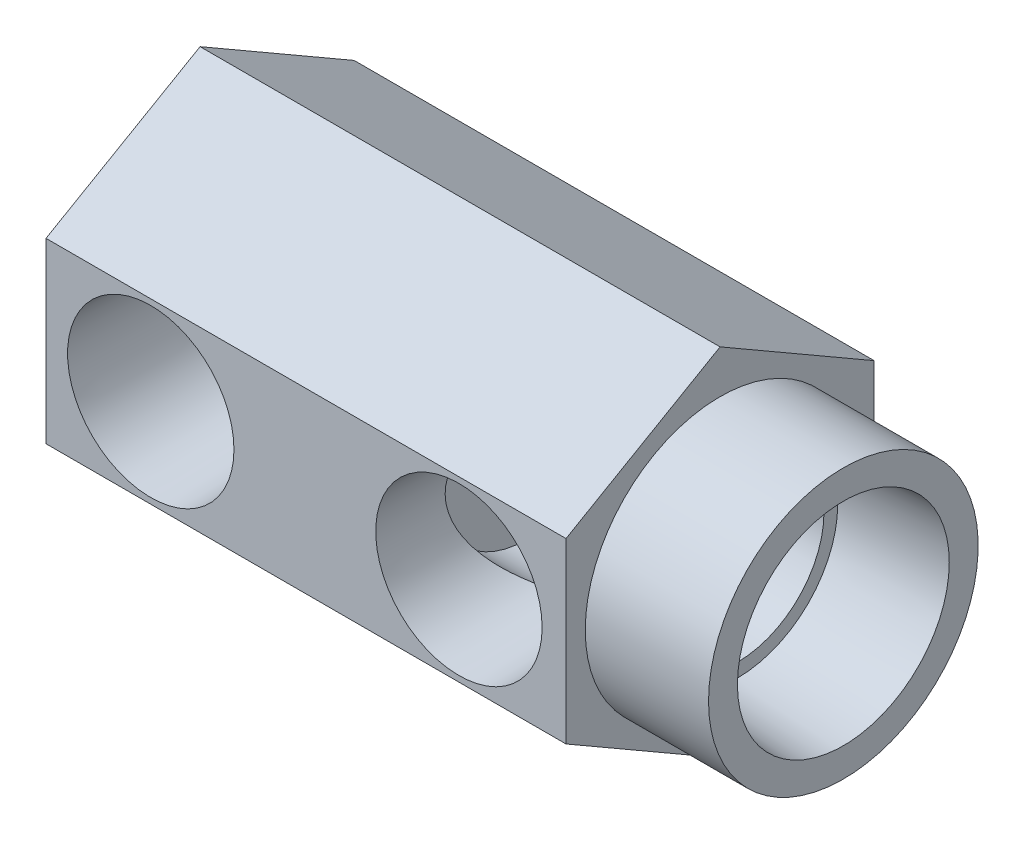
ISO-10303-21;
HEADER;
FILE_DESCRIPTION(('STEP AP214'),'2;1');
FILE_NAME('part.step','',(''),(''),'','','');
FILE_SCHEMA(('AUTOMOTIVE_DESIGN { 1 0 10303 214 1 1 1 1 }'));
ENDSEC;
DATA;
#1=APPLICATION_CONTEXT('core data for automotive mechanical design processes');
#2=APPLICATION_PROTOCOL_DEFINITION('international standard','automotive_design',2000,#1);
#3=PRODUCT_CONTEXT('',#1,'mechanical');
#4=PRODUCT('Part','Part','',(#3));
#5=PRODUCT_RELATED_PRODUCT_CATEGORY('part','',(#4));
#6=PRODUCT_DEFINITION_FORMATION('','',#4);
#7=PRODUCT_DEFINITION_CONTEXT('part definition',#1,'design');
#8=PRODUCT_DEFINITION('design','',#6,#7);
#9=PRODUCT_DEFINITION_SHAPE('','',#8);
#10=(LENGTH_UNIT() NAMED_UNIT(*) SI_UNIT(.MILLI.,.METRE.));
#11=(NAMED_UNIT(*) PLANE_ANGLE_UNIT() SI_UNIT($,.RADIAN.));
#12=(NAMED_UNIT(*) SI_UNIT($,.STERADIAN.) SOLID_ANGLE_UNIT());
#13=UNCERTAINTY_MEASURE_WITH_UNIT(LENGTH_MEASURE(1.E-05),#10,'distance_accuracy_value','');
#14=(GEOMETRIC_REPRESENTATION_CONTEXT(3) GLOBAL_UNCERTAINTY_ASSIGNED_CONTEXT((#13)) GLOBAL_UNIT_ASSIGNED_CONTEXT((#10,
#11,#12)) REPRESENTATION_CONTEXT('',''));
#15=CARTESIAN_POINT('',(0.,0.,0.));
#16=DIRECTION('',(0.,0.,1.));
#17=DIRECTION('',(1.,0.,0.));
#18=AXIS2_PLACEMENT_3D('',#15,#16,#17);
#19=CARTESIAN_POINT('',(53.0225,0.,0.));
#20=DIRECTION('',(-1.,0.,0.));
#21=DIRECTION('',(0.,0.,1.));
#22=AXIS2_PLACEMENT_3D('',#19,#20,#21);
#23=PLANE('',#22);
#24=CARTESIAN_POINT('',(53.0225,0.,0.));
#25=DIRECTION('',(-1.,0.,0.));
#26=DIRECTION('',(0.,0.,1.));
#27=AXIS2_PLACEMENT_3D('',#24,#25,#26);
#28=CIRCLE('',#27,11.1125);
#29=CARTESIAN_POINT('',(53.0225,0.,11.1125));
#30=VERTEX_POINT('',#29);
#31=EDGE_CURVE('E137',#30,#30,#28,.T.);
#32=ORIENTED_EDGE('',*,*,#31,.F.);
#33=EDGE_LOOP('',(#32));
#34=FACE_BOUND('',#33,.T.);
#35=CARTESIAN_POINT('',(53.0225,0.,0.));
#36=DIRECTION('',(-1.,0.,0.));
#37=DIRECTION('',(0.,0.,1.));
#38=AXIS2_PLACEMENT_3D('',#35,#36,#37);
#39=CIRCLE('',#38,8.73125);
#40=CARTESIAN_POINT('',(53.0225,0.,8.73125));
#41=VERTEX_POINT('',#40);
#42=EDGE_CURVE('E161',#41,#41,#39,.T.);
#43=ORIENTED_EDGE('',*,*,#42,.T.);
#44=EDGE_LOOP('',(#43));
#45=FACE_BOUND('',#44,.T.);
#46=ADVANCED_FACE('F35',(#34,#45),#23,.F.);
#47=CARTESIAN_POINT('',(42.8625,-7.33234841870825,-12.7));
#48=DIRECTION('',(0.,0.,1.));
#49=DIRECTION('',(0.,-1.,0.));
#50=AXIS2_PLACEMENT_3D('',#47,#48,#49);
#51=PLANE('',#50);
#52=CARTESIAN_POINT('',(8.636,0.,-12.7));
#53=DIRECTION('',(0.,0.,-1.));
#54=DIRECTION('',(0.,1.,0.));
#55=AXIS2_PLACEMENT_3D('',#52,#53,#54);
#56=CIRCLE('',#55,6.858);
#57=CARTESIAN_POINT('',(8.636,6.858,-12.7));
#58=VERTEX_POINT('',#57);
#59=EDGE_CURVE('E269',#58,#58,#56,.T.);
#60=ORIENTED_EDGE('',*,*,#59,.F.);
#61=EDGE_LOOP('',(#60));
#62=FACE_BOUND('',#61,.T.);
#63=DIRECTION('',(0.,1.,0.));
#64=VECTOR('',#63,1.);
#65=CARTESIAN_POINT('',(0.,-7.33234841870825,-12.7));
#66=LINE('',#65,#64);
#67=CARTESIAN_POINT('',(0.,-7.33234841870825,-12.7));
#68=VERTEX_POINT('',#67);
#69=CARTESIAN_POINT('',(0.,7.33234841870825,-12.7));
#70=VERTEX_POINT('',#69);
#71=EDGE_CURVE('E133',#68,#70,#66,.T.);
#72=ORIENTED_EDGE('',*,*,#71,.T.);
#73=DIRECTION('',(-1.,0.,0.));
#74=VECTOR('',#73,1.);
#75=CARTESIAN_POINT('',(42.8625,7.33234841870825,-12.7));
#76=LINE('',#75,#74);
#77=CARTESIAN_POINT('',(42.8625,7.33234841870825,-12.7));
#78=VERTEX_POINT('',#77);
#79=EDGE_CURVE('E152',#78,#70,#76,.T.);
#80=ORIENTED_EDGE('',*,*,#79,.F.);
#81=DIRECTION('',(0.,1.,0.));
#82=VECTOR('',#81,1.);
#83=CARTESIAN_POINT('',(42.8625,-7.33234841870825,-12.7));
#84=LINE('',#83,#82);
#85=CARTESIAN_POINT('',(42.8625,-7.33234841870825,-12.7));
#86=VERTEX_POINT('',#85);
#87=EDGE_CURVE('E145',#86,#78,#84,.T.);
#88=ORIENTED_EDGE('',*,*,#87,.F.);
#89=DIRECTION('',(-1.,0.,0.));
#90=VECTOR('',#89,1.);
#91=CARTESIAN_POINT('',(42.8625,-7.33234841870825,-12.7));
#92=LINE('',#91,#90);
#93=EDGE_CURVE('E129',#86,#68,#92,.T.);
#94=ORIENTED_EDGE('',*,*,#93,.T.);
#95=EDGE_LOOP('',(#72,#80,#88,#94));
#96=FACE_BOUND('',#95,.T.);
#97=ADVANCED_FACE('F37',(#62,#96),#51,.F.);
#98=CARTESIAN_POINT('',(42.8625,7.33234841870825,-12.7));
#99=DIRECTION('',(0.,-0.866025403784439,0.5));
#100=DIRECTION('',(0.,-0.5,-0.866025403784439));
#101=AXIS2_PLACEMENT_3D('',#98,#99,#100);
#102=PLANE('',#101);
#103=DIRECTION('',(0.,0.5,0.866025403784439));
#104=VECTOR('',#103,1.);
#105=CARTESIAN_POINT('',(0.,7.33234841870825,-12.7));
#106=LINE('',#105,#104);
#107=CARTESIAN_POINT('',(0.,14.6646968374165,0.));
#108=VERTEX_POINT('',#107);
#109=EDGE_CURVE('E136',#70,#108,#106,.T.);
#110=ORIENTED_EDGE('',*,*,#109,.T.);
#111=DIRECTION('',(-1.,0.,0.));
#112=VECTOR('',#111,1.);
#113=CARTESIAN_POINT('',(42.8625,14.6646968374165,0.));
#114=LINE('',#113,#112);
#115=CARTESIAN_POINT('',(42.8625,14.6646968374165,0.));
#116=VERTEX_POINT('',#115);
#117=EDGE_CURVE('E149',#116,#108,#114,.T.);
#118=ORIENTED_EDGE('',*,*,#117,.F.);
#119=DIRECTION('',(0.,0.5,0.866025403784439));
#120=VECTOR('',#119,1.);
#121=CARTESIAN_POINT('',(42.8625,7.33234841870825,-12.7));
#122=LINE('',#121,#120);
#123=EDGE_CURVE('E96',#78,#116,#122,.T.);
#124=ORIENTED_EDGE('',*,*,#123,.F.);
#125=ORIENTED_EDGE('',*,*,#79,.T.);
#126=EDGE_LOOP('',(#110,#118,#124,#125));
#127=FACE_BOUND('',#126,.T.);
#128=ADVANCED_FACE('F197',(#127),#102,.F.);
#129=CARTESIAN_POINT('',(42.8625,14.6646968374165,0.));
#130=DIRECTION('',(0.,-0.866025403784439,-0.5));
#131=DIRECTION('',(0.,0.5,-0.866025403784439));
#132=AXIS2_PLACEMENT_3D('',#129,#130,#131);
#133=PLANE('',#132);
#134=DIRECTION('',(0.,-0.5,0.866025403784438));
#135=VECTOR('',#134,1.);
#136=CARTESIAN_POINT('',(0.,14.6646968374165,0.));
#137=LINE('',#136,#135);
#138=CARTESIAN_POINT('',(0.,7.33234841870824,12.7));
#139=VERTEX_POINT('',#138);
#140=EDGE_CURVE('E139',#108,#139,#137,.T.);
#141=ORIENTED_EDGE('',*,*,#140,.T.);
#142=DIRECTION('',(-1.,0.,0.));
#143=VECTOR('',#142,1.);
#144=CARTESIAN_POINT('',(42.8625,7.33234841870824,12.7));
#145=LINE('',#144,#143);
#146=CARTESIAN_POINT('',(42.8625,7.33234841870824,12.7));
#147=VERTEX_POINT('',#146);
#148=EDGE_CURVE('E124',#147,#139,#145,.T.);
#149=ORIENTED_EDGE('',*,*,#148,.F.);
#150=DIRECTION('',(0.,-0.5,0.866025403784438));
#151=VECTOR('',#150,1.);
#152=CARTESIAN_POINT('',(42.8625,14.6646968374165,0.));
#153=LINE('',#152,#151);
#154=EDGE_CURVE('E112',#116,#147,#153,.T.);
#155=ORIENTED_EDGE('',*,*,#154,.F.);
#156=ORIENTED_EDGE('',*,*,#117,.T.);
#157=EDGE_LOOP('',(#141,#149,#155,#156));
#158=FACE_BOUND('',#157,.T.);
#159=ADVANCED_FACE('F222',(#158),#133,.F.);
#160=CARTESIAN_POINT('',(42.8625,7.33234841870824,12.7));
#161=DIRECTION('',(0.,0.,-1.));
#162=DIRECTION('',(-1.,0.,0.));
#163=AXIS2_PLACEMENT_3D('',#160,#161,#162);
#164=PLANE('',#163);
#165=CARTESIAN_POINT('',(8.636,0.,12.7));
#166=DIRECTION('',(0.,0.,1.));
#167=DIRECTION('',(1.,0.,0.));
#168=AXIS2_PLACEMENT_3D('',#165,#166,#167);
#169=CIRCLE('',#168,6.858);
#170=CARTESIAN_POINT('',(15.494,0.,12.7));
#171=VERTEX_POINT('',#170);
#172=EDGE_CURVE('E260',#171,#171,#169,.T.);
#173=ORIENTED_EDGE('',*,*,#172,.F.);
#174=EDGE_LOOP('',(#173));
#175=FACE_BOUND('',#174,.T.);
#176=CARTESIAN_POINT('',(34.036,0.,12.7));
#177=DIRECTION('',(0.,0.,1.));
#178=DIRECTION('',(1.,0.,0.));
#179=AXIS2_PLACEMENT_3D('',#176,#177,#178);
#180=CIRCLE('',#179,6.858);
#181=CARTESIAN_POINT('',(40.894,0.,12.7));
#182=VERTEX_POINT('',#181);
#183=EDGE_CURVE('E162',#182,#182,#180,.T.);
#184=ORIENTED_EDGE('',*,*,#183,.F.);
#185=EDGE_LOOP('',(#184));
#186=FACE_BOUND('',#185,.T.);
#187=DIRECTION('',(0.,-1.,0.));
#188=VECTOR('',#187,1.);
#189=CARTESIAN_POINT('',(0.,7.33234841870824,12.7));
#190=LINE('',#189,#188);
#191=CARTESIAN_POINT('',(0.,-7.33234841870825,12.7));
#192=VERTEX_POINT('',#191);
#193=EDGE_CURVE('E121',#139,#192,#190,.T.);
#194=ORIENTED_EDGE('',*,*,#193,.T.);
#195=DIRECTION('',(-1.,0.,0.));
#196=VECTOR('',#195,1.);
#197=CARTESIAN_POINT('',(42.8625,-7.33234841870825,12.7));
#198=LINE('',#197,#196);
#199=CARTESIAN_POINT('',(42.8625,-7.33234841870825,12.7));
#200=VERTEX_POINT('',#199);
#201=EDGE_CURVE('E118',#200,#192,#198,.T.);
#202=ORIENTED_EDGE('',*,*,#201,.F.);
#203=DIRECTION('',(0.,-1.,0.));
#204=VECTOR('',#203,1.);
#205=CARTESIAN_POINT('',(42.8625,7.33234841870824,12.7));
#206=LINE('',#205,#204);
#207=EDGE_CURVE('E105',#147,#200,#206,.T.);
#208=ORIENTED_EDGE('',*,*,#207,.F.);
#209=ORIENTED_EDGE('',*,*,#148,.T.);
#210=EDGE_LOOP('',(#194,#202,#208,#209));
#211=FACE_BOUND('',#210,.T.);
#212=ADVANCED_FACE('F119',(#175,#186,#211),#164,.F.);
#213=CARTESIAN_POINT('',(42.8625,-7.33234841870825,12.7));
#214=DIRECTION('',(0.,0.866025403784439,-0.5));
#215=DIRECTION('',(0.,0.5,0.866025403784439));
#216=AXIS2_PLACEMENT_3D('',#213,#214,#215);
#217=PLANE('',#216);
#218=DIRECTION('',(0.,-0.5,-0.866025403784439));
#219=VECTOR('',#218,1.);
#220=CARTESIAN_POINT('',(0.,-7.33234841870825,12.7));
#221=LINE('',#220,#219);
#222=CARTESIAN_POINT('',(0.,-14.6646968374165,0.));
#223=VERTEX_POINT('',#222);
#224=EDGE_CURVE('E142',#192,#223,#221,.T.);
#225=ORIENTED_EDGE('',*,*,#224,.T.);
#226=DIRECTION('',(-1.,0.,0.));
#227=VECTOR('',#226,1.);
#228=CARTESIAN_POINT('',(42.8625,-14.6646968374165,0.));
#229=LINE('',#228,#227);
#230=CARTESIAN_POINT('',(42.8625,-14.6646968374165,0.));
#231=VERTEX_POINT('',#230);
#232=EDGE_CURVE('E125',#231,#223,#229,.T.);
#233=ORIENTED_EDGE('',*,*,#232,.F.);
#234=DIRECTION('',(0.,-0.5,-0.866025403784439));
#235=VECTOR('',#234,1.);
#236=CARTESIAN_POINT('',(42.8625,-7.33234841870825,12.7));
#237=LINE('',#236,#235);
#238=EDGE_CURVE('E109',#200,#231,#237,.T.);
#239=ORIENTED_EDGE('',*,*,#238,.F.);
#240=ORIENTED_EDGE('',*,*,#201,.T.);
#241=EDGE_LOOP('',(#225,#233,#239,#240));
#242=FACE_BOUND('',#241,.T.);
#243=ADVANCED_FACE('F127',(#242),#217,.F.);
#244=CARTESIAN_POINT('',(42.8625,-14.6646968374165,0.));
#245=DIRECTION('',(0.,0.866025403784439,0.5));
#246=DIRECTION('',(0.,-0.5,0.866025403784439));
#247=AXIS2_PLACEMENT_3D('',#244,#245,#246);
#248=PLANE('',#247);
#249=DIRECTION('',(0.,0.5,-0.866025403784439));
#250=VECTOR('',#249,1.);
#251=CARTESIAN_POINT('',(0.,-14.6646968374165,0.));
#252=LINE('',#251,#250);
#253=EDGE_CURVE('E87',#223,#68,#252,.T.);
#254=ORIENTED_EDGE('',*,*,#253,.T.);
#255=ORIENTED_EDGE('',*,*,#93,.F.);
#256=DIRECTION('',(0.,0.5,-0.866025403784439));
#257=VECTOR('',#256,1.);
#258=CARTESIAN_POINT('',(42.8625,-14.6646968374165,0.));
#259=LINE('',#258,#257);
#260=EDGE_CURVE('E60',#231,#86,#259,.T.);
#261=ORIENTED_EDGE('',*,*,#260,.F.);
#262=ORIENTED_EDGE('',*,*,#232,.T.);
#263=EDGE_LOOP('',(#254,#255,#261,#262));
#264=FACE_BOUND('',#263,.T.);
#265=ADVANCED_FACE('F211',(#264),#248,.F.);
#266=CARTESIAN_POINT('',(42.8625,7.33234841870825,-12.7));
#267=DIRECTION('',(1.,0.,0.));
#268=DIRECTION('',(0.,0.,-1.));
#269=AXIS2_PLACEMENT_3D('',#266,#267,#268);
#270=PLANE('',#269);
#271=CARTESIAN_POINT('',(42.8625,0.,0.));
#272=DIRECTION('',(1.,0.,0.));
#273=DIRECTION('',(0.,0.,-1.));
#274=AXIS2_PLACEMENT_3D('',#271,#272,#273);
#275=CIRCLE('',#274,11.1125);
#276=CARTESIAN_POINT('',(42.8625,0.,11.1125));
#277=VERTEX_POINT('',#276);
#278=EDGE_CURVE('E44',#277,#277,#275,.T.);
#279=ORIENTED_EDGE('',*,*,#278,.F.);
#280=EDGE_LOOP('',(#279));
#281=FACE_BOUND('',#280,.T.);
#282=ORIENTED_EDGE('',*,*,#87,.T.);
#283=ORIENTED_EDGE('',*,*,#123,.T.);
#284=ORIENTED_EDGE('',*,*,#154,.T.);
#285=ORIENTED_EDGE('',*,*,#207,.T.);
#286=ORIENTED_EDGE('',*,*,#238,.T.);
#287=ORIENTED_EDGE('',*,*,#260,.T.);
#288=EDGE_LOOP('',(#282,#283,#284,#285,#286,#287));
#289=FACE_BOUND('',#288,.T.);
#290=ADVANCED_FACE('F107',(#281,#289),#270,.T.);
#291=CARTESIAN_POINT('',(0.,7.33234841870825,-12.7));
#292=DIRECTION('',(1.,0.,0.));
#293=DIRECTION('',(0.,0.,-1.));
#294=AXIS2_PLACEMENT_3D('',#291,#292,#293);
#295=PLANE('',#294);
#296=ORIENTED_EDGE('',*,*,#71,.F.);
#297=ORIENTED_EDGE('',*,*,#253,.F.);
#298=ORIENTED_EDGE('',*,*,#224,.F.);
#299=ORIENTED_EDGE('',*,*,#193,.F.);
#300=ORIENTED_EDGE('',*,*,#140,.F.);
#301=ORIENTED_EDGE('',*,*,#109,.F.);
#302=EDGE_LOOP('',(#296,#297,#298,#299,#300,#301));
#303=FACE_BOUND('',#302,.T.);
#304=ADVANCED_FACE('F207',(#303),#295,.F.);
#305=CARTESIAN_POINT('',(53.0225,0.,0.));
#306=DIRECTION('',(-1.,0.,0.));
#307=DIRECTION('',(0.,0.,1.));
#308=AXIS2_PLACEMENT_3D('',#305,#306,#307);
#309=CYLINDRICAL_SURFACE('',#308,11.1125);
#310=CARTESIAN_POINT('',(42.8625,0.,11.1125));
#311=CARTESIAN_POINT('',(42.9683333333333,0.,11.1125));
#312=CARTESIAN_POINT('',(43.0741666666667,0.,11.1125));
#313=CARTESIAN_POINT('',(43.2858333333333,0.,11.1125));
#314=CARTESIAN_POINT('',(43.3916666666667,0.,11.1125));
#315=CARTESIAN_POINT('',(43.6033333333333,0.,11.1125));
#316=CARTESIAN_POINT('',(43.7091666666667,0.,11.1125));
#317=CARTESIAN_POINT('',(43.9208333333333,0.,11.1125));
#318=CARTESIAN_POINT('',(44.0266666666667,0.,11.1125));
#319=CARTESIAN_POINT('',(44.2383333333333,0.,11.1125));
#320=CARTESIAN_POINT('',(44.3441666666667,0.,11.1125));
#321=CARTESIAN_POINT('',(44.5558333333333,0.,11.1125));
#322=CARTESIAN_POINT('',(44.6616666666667,0.,11.1125));
#323=CARTESIAN_POINT('',(44.8733333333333,0.,11.1125));
#324=CARTESIAN_POINT('',(44.9791666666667,0.,11.1125));
#325=CARTESIAN_POINT('',(45.1908333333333,0.,11.1125));
#326=CARTESIAN_POINT('',(45.2966666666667,0.,11.1125));
#327=CARTESIAN_POINT('',(45.5083333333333,0.,11.1125));
#328=CARTESIAN_POINT('',(45.6141666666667,0.,11.1125));
#329=CARTESIAN_POINT('',(45.8258333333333,0.,11.1125));
#330=CARTESIAN_POINT('',(45.9316666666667,0.,11.1125));
#331=CARTESIAN_POINT('',(46.1433333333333,0.,11.1125));
#332=CARTESIAN_POINT('',(46.2491666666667,0.,11.1125));
#333=CARTESIAN_POINT('',(46.4608333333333,0.,11.1125));
#334=CARTESIAN_POINT('',(46.5666666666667,0.,11.1125));
#335=CARTESIAN_POINT('',(46.7783333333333,0.,11.1125));
#336=CARTESIAN_POINT('',(46.8841666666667,0.,11.1125));
#337=CARTESIAN_POINT('',(47.0958333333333,0.,11.1125));
#338=CARTESIAN_POINT('',(47.2016666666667,0.,11.1125));
#339=CARTESIAN_POINT('',(47.4133333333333,0.,11.1125));
#340=CARTESIAN_POINT('',(47.5191666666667,0.,11.1125));
#341=CARTESIAN_POINT('',(47.7308333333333,0.,11.1125));
#342=CARTESIAN_POINT('',(47.8366666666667,0.,11.1125));
#343=CARTESIAN_POINT('',(48.0483333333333,0.,11.1125));
#344=CARTESIAN_POINT('',(48.1541666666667,0.,11.1125));
#345=CARTESIAN_POINT('',(48.3658333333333,0.,11.1125));
#346=CARTESIAN_POINT('',(48.4716666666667,0.,11.1125));
#347=CARTESIAN_POINT('',(48.6833333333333,0.,11.1125));
#348=CARTESIAN_POINT('',(48.7891666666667,0.,11.1125));
#349=CARTESIAN_POINT('',(49.0008333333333,0.,11.1125));
#350=CARTESIAN_POINT('',(49.1066666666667,0.,11.1125));
#351=CARTESIAN_POINT('',(49.3183333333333,0.,11.1125));
#352=CARTESIAN_POINT('',(49.4241666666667,0.,11.1125));
#353=CARTESIAN_POINT('',(49.6358333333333,0.,11.1125));
#354=CARTESIAN_POINT('',(49.7416666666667,0.,11.1125));
#355=CARTESIAN_POINT('',(49.9533333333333,0.,11.1125));
#356=CARTESIAN_POINT('',(50.0591666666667,0.,11.1125));
#357=CARTESIAN_POINT('',(50.2708333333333,0.,11.1125));
#358=CARTESIAN_POINT('',(50.3766666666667,0.,11.1125));
#359=CARTESIAN_POINT('',(50.5883333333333,0.,11.1125));
#360=CARTESIAN_POINT('',(50.6941666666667,0.,11.1125));
#361=CARTESIAN_POINT('',(50.9058333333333,0.,11.1125));
#362=CARTESIAN_POINT('',(51.0116666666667,0.,11.1125));
#363=CARTESIAN_POINT('',(51.2233333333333,0.,11.1125));
#364=CARTESIAN_POINT('',(51.3291666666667,0.,11.1125));
#365=CARTESIAN_POINT('',(51.5408333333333,0.,11.1125));
#366=CARTESIAN_POINT('',(51.6466666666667,0.,11.1125));
#367=CARTESIAN_POINT('',(51.8583333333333,0.,11.1125));
#368=CARTESIAN_POINT('',(51.9641666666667,0.,11.1125));
#369=CARTESIAN_POINT('',(52.1758333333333,0.,11.1125));
#370=CARTESIAN_POINT('',(52.2816666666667,0.,11.1125));
#371=CARTESIAN_POINT('',(52.4933333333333,0.,11.1125));
#372=CARTESIAN_POINT('',(52.5991666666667,0.,11.1125));
#373=CARTESIAN_POINT('',(52.8108333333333,0.,11.1125));
#374=CARTESIAN_POINT('',(52.9166666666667,0.,11.1125));
#375=CARTESIAN_POINT('',(53.0225,0.,11.1125));
#376=B_SPLINE_CURVE_WITH_KNOTS('',3,(#310,#311,#312,#313,#314,#315,#316,#317,#318,#319,#320,
#321,#322,#323,#324,#325,#326,#327,#328,#329,#330,#331,#332,#333,#334,#335,#336,#337,#338,#339,
#340,#341,#342,#343,#344,#345,#346,#347,#348,#349,#350,#351,#352,#353,#354,#355,#356,#357,#358,
#359,#360,#361,#362,#363,#364,#365,#366,#367,#368,#369,#370,#371,#372,#373,#374,#375),
.UNSPECIFIED.,.F.,.F.,(4,2,2,2,2,2,2,2,2,2,2,2,2,2,2,2,2,2,2,2,2,2,2,2,2,2,2,2,2,2,2,2,4),(0.,
0.317500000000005,0.635000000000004,0.952500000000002,1.27,1.5875,1.905,2.2225,2.54,
2.85750000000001,3.175,3.4925,3.81,4.12750000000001,4.445,4.7625,5.08,5.39750000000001,
5.71500000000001,6.0325,6.35,6.66750000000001,6.985,7.3025,7.62,7.93750000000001,
8.25500000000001,8.5725,8.89000000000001,9.20750000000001,9.52500000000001,9.8425,10.16),.UNSPECIFIED.);
#377=EDGE_CURVE('BSEAM204',#277,#30,#376,.T.);
#378=ORIENTED_EDGE('',*,*,#278,.T.);
#379=ORIENTED_EDGE('',*,*,#31,.T.);
#380=ORIENTED_EDGE('',*,*,#377,.T.);
#381=ORIENTED_EDGE('',*,*,#377,.F.);
#382=EDGE_LOOP('',(#378,#380,#379,#381));
#383=FACE_BOUND('',#382,.T.);
#384=ADVANCED_FACE('F204',(#383),#309,.T.);
#385=CARTESIAN_POINT('',(53.0225,0.,0.));
#386=DIRECTION('',(1.,0.,0.));
#387=DIRECTION('',(0.,0.,-1.));
#388=AXIS2_PLACEMENT_3D('',#385,#386,#387);
#389=CONICAL_SURFACE('',#388,8.73125,0.0523598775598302);
#390=CARTESIAN_POINT('',(44.2849,0.,0.));
#391=DIRECTION('',(-1.,0.,0.));
#392=DIRECTION('',(0.,0.,1.));
#393=AXIS2_PLACEMENT_3D('',#390,#391,#392);
#394=CIRCLE('',#393,8.2733317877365);
#395=CARTESIAN_POINT('',(44.2849,0.,8.2733317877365));
#396=VERTEX_POINT('',#395);
#397=EDGE_CURVE('E241',#396,#396,#394,.T.);
#398=ORIENTED_EDGE('',*,*,#397,.T.);
#399=EDGE_LOOP('',(#398));
#400=FACE_BOUND('',#399,.T.);
#401=ORIENTED_EDGE('',*,*,#42,.F.);
#402=EDGE_LOOP('',(#401));
#403=FACE_BOUND('',#402,.T.);
#404=ADVANCED_FACE('F203',(#400,#403),#389,.F.);
#405=CARTESIAN_POINT('',(44.2849,0.,-7.14375));
#406=DIRECTION('',(1.,0.,0.));
#407=DIRECTION('',(0.,0.,-1.));
#408=AXIS2_PLACEMENT_3D('',#405,#406,#407);
#409=PLANE('',#408);
#410=CARTESIAN_POINT('',(44.2849,0.,0.));
#411=DIRECTION('',(-1.,0.,0.));
#412=DIRECTION('',(0.,0.,1.));
#413=AXIS2_PLACEMENT_3D('',#410,#411,#412);
#414=CIRCLE('',#413,7.14375);
#415=CARTESIAN_POINT('',(44.2849,0.,7.14375));
#416=VERTEX_POINT('',#415);
#417=EDGE_CURVE('E244',#416,#416,#414,.T.);
#418=ORIENTED_EDGE('',*,*,#417,.T.);
#419=EDGE_LOOP('',(#418));
#420=FACE_BOUND('',#419,.T.);
#421=ORIENTED_EDGE('',*,*,#397,.F.);
#422=EDGE_LOOP('',(#421));
#423=FACE_BOUND('',#422,.T.);
#424=ADVANCED_FACE('F187',(#420,#423),#409,.T.);
#425=CARTESIAN_POINT('',(0.,0.,0.));
#426=DIRECTION('',(-1.,0.,0.));
#427=DIRECTION('',(0.,0.,1.));
#428=AXIS2_PLACEMENT_3D('',#425,#426,#427);
#429=CYLINDRICAL_SURFACE('',#428,7.14375);
#430=CARTESIAN_POINT('',(29.5083238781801,-4.84980912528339,5.24523766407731));
#431=CARTESIAN_POINT('',(29.3823544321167,-4.73649479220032,5.35000911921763));
#432=CARTESIAN_POINT('',(29.2599964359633,-4.61761883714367,5.45310749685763));
#433=CARTESIAN_POINT('',(29.0231642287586,-4.36856062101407,5.65460311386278));
#434=CARTESIAN_POINT('',(28.9086917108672,-4.2383759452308,5.75299934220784));
#435=CARTESIAN_POINT('',(28.5788727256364,-3.83115643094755,6.03862646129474));
#436=CARTESIAN_POINT('',(28.3763742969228,-3.5367918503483,6.21692838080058));
#437=CARTESIAN_POINT('',(28.0538983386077,-2.96968952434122,6.50328768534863));
#438=CARTESIAN_POINT('',(27.9255188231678,-2.70526788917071,6.61823869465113));
#439=CARTESIAN_POINT('',(27.7586939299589,-2.29028648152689,6.76826870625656));
#440=CARTESIAN_POINT('',(27.7073630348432,-2.14884896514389,6.8145581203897));
#441=CARTESIAN_POINT('',(27.6140676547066,-1.86054994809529,6.89884323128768));
#442=CARTESIAN_POINT('',(27.5720989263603,-1.71369093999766,6.93684268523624));
#443=CARTESIAN_POINT('',(27.4979485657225,-1.414195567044,7.00406775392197));
#444=CARTESIAN_POINT('',(27.4658506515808,-1.26152149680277,7.03321829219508));
#445=CARTESIAN_POINT('',(27.4125567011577,-0.952726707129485,7.08165900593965));
#446=CARTESIAN_POINT('',(27.3913607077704,-0.796605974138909,7.10094914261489));
#447=CARTESIAN_POINT('',(27.3603434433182,-0.482397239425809,7.12918813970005));
#448=CARTESIAN_POINT('',(27.3505155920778,-0.324310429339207,7.13814298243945));
#449=CARTESIAN_POINT('',(27.3424395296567,-0.00760472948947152,7.14550111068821));
#450=CARTESIAN_POINT('',(27.3441899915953,0.151014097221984,7.14390560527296));
#451=CARTESIAN_POINT('',(27.3582642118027,0.447084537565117,7.13108429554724));
#452=CARTESIAN_POINT('',(27.3692131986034,0.584659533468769,7.12111067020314));
#453=CARTESIAN_POINT('',(27.3997039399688,0.858102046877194,7.09335714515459));
#454=CARTESIAN_POINT('',(27.4192484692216,0.993968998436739,7.07557472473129));
#455=CARTESIAN_POINT('',(27.466605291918,1.26299966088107,7.03253460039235));
#456=CARTESIAN_POINT('',(27.4944148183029,1.39616426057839,7.00727939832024));
#457=CARTESIAN_POINT('',(27.5578761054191,1.65907882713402,6.94973123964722));
#458=CARTESIAN_POINT('',(27.5935308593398,1.78882746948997,6.91743559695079));
#459=CARTESIAN_POINT('',(27.7129858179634,2.17658998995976,6.80942962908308));
#460=CARTESIAN_POINT('',(27.8084072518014,2.42828613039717,6.72339475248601));
#461=CARTESIAN_POINT('',(28.0252282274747,2.91081077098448,6.52902769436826));
#462=CARTESIAN_POINT('',(28.1466402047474,3.14162920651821,6.4206848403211));
#463=CARTESIAN_POINT('',(28.3782585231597,3.52618432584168,6.21564053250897));
#464=CARTESIAN_POINT('',(28.4837716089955,3.68483726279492,6.12271976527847));
#465=CARTESIAN_POINT('',(28.7055260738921,3.98924030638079,5.92888551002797));
#466=CARTESIAN_POINT('',(28.8217685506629,4.13498908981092,5.82797120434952));
#467=CARTESIAN_POINT('',(29.0639877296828,4.4139197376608,5.61968420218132));
#468=CARTESIAN_POINT('',(29.1899871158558,4.54707061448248,5.51229659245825));
#469=CARTESIAN_POINT('',(29.4505015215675,4.80059283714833,5.29297268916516));
#470=CARTESIAN_POINT('',(29.5850153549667,4.92096595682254,5.18103702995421));
#471=CARTESIAN_POINT('',(29.8652504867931,5.15193999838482,4.95154587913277));
#472=CARTESIAN_POINT('',(30.0111628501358,5.26223846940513,4.83392000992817));
#473=CARTESIAN_POINT('',(30.3109913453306,5.47001778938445,4.5974813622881));
#474=CARTESIAN_POINT('',(30.4649093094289,5.56749568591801,4.47866831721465));
#475=CARTESIAN_POINT('',(30.7805694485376,5.74962950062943,4.24230260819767));
#476=CARTESIAN_POINT('',(30.9422973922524,5.83430765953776,4.12474809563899));
#477=CARTESIAN_POINT('',(31.2743883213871,5.99102033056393,3.8936229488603));
#478=CARTESIAN_POINT('',(31.4447466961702,6.06306150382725,3.7800502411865));
#479=CARTESIAN_POINT('',(31.7978500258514,6.19515862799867,3.55947956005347));
#480=CARTESIAN_POINT('',(31.9807328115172,6.25503666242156,3.45259311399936));
#481=CARTESIAN_POINT('',(32.358632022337,6.36064590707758,3.25391190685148));
#482=CARTESIAN_POINT('',(32.5536444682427,6.40638172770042,3.1621122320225));
#483=CARTESIAN_POINT('',(32.9222061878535,6.47520032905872,3.01831607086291));
#484=CARTESIAN_POINT('',(33.0935699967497,6.50084233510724,2.9621704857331));
#485=CARTESIAN_POINT('',(33.3562389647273,6.52980353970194,2.89747888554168));
#486=CARTESIAN_POINT('',(33.4446376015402,6.53787016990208,2.87917840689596));
#487=CARTESIAN_POINT('',(33.6228631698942,6.55066806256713,2.84994222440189));
#488=CARTESIAN_POINT('',(33.7126893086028,6.55540111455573,2.83900256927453));
#489=CARTESIAN_POINT('',(33.8939412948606,6.56142550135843,2.82505214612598));
#490=CARTESIAN_POINT('',(33.9853742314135,6.56268366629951,2.82211779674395));
#491=CARTESIAN_POINT('',(34.1681034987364,6.56162318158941,2.82458265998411));
#492=CARTESIAN_POINT('',(34.2593998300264,6.55930454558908,2.82998184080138));
#493=CARTESIAN_POINT('',(34.4411485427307,6.55115703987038,2.84879031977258));
#494=CARTESIAN_POINT('',(34.5315992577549,6.54532230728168,2.86221299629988));
#495=CARTESIAN_POINT('',(34.7108593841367,6.53030374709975,2.89631629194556));
#496=CARTESIAN_POINT('',(34.7996676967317,6.52111775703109,2.91700159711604));
#497=CARTESIAN_POINT('',(35.1206850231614,6.48175953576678,3.00411504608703));
#498=CARTESIAN_POINT('',(35.3466817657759,6.44203402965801,3.08954587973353));
#499=CARTESIAN_POINT('',(35.6732857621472,6.36852534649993,3.23699418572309));
#500=CARTESIAN_POINT('',(35.7803260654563,6.34162243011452,3.28950733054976));
#501=CARTESIAN_POINT('',(35.9906747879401,6.28341303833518,3.3993741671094));
#502=CARTESIAN_POINT('',(36.0939843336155,6.25210790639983,3.45672637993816));
#503=CARTESIAN_POINT('',(36.3931128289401,6.15375523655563,3.63067422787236));
#504=CARTESIAN_POINT('',(36.5841984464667,6.08086385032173,3.7520873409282));
#505=CARTESIAN_POINT('',(36.9555584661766,5.91986154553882,4.00131490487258));
#506=CARTESIAN_POINT('',(37.1358239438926,5.83173828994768,4.12913448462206));
#507=CARTESIAN_POINT('',(37.4867903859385,5.64023525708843,4.38711347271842));
#508=CARTESIAN_POINT('',(37.6574766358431,5.53683284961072,4.51727609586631));
#509=CARTESIAN_POINT('',(37.9892506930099,5.3147090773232,4.77663018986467));
#510=CARTESIAN_POINT('',(38.1503414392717,5.19599243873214,4.90582194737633));
#511=CARTESIAN_POINT('',(38.4717958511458,4.93546969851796,5.16821607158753));
#512=CARTESIAN_POINT('',(38.6315672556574,4.79271987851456,5.3012118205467));
#513=CARTESIAN_POINT('',(38.9390566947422,4.48916243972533,5.56061661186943));
#514=CARTESIAN_POINT('',(39.0867710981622,4.32834941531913,5.6870236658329));
#515=CARTESIAN_POINT('',(39.3678859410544,3.98902350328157,5.92994514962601));
#516=CARTESIAN_POINT('',(39.5013354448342,3.81057563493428,6.04649318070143));
#517=CARTESIAN_POINT('',(39.752163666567,3.43564684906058,6.26711376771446));
#518=CARTESIAN_POINT('',(39.8695553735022,3.2391807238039,6.37119639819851));
#519=CARTESIAN_POINT('',(40.043053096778,2.90961722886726,6.52581221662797));
#520=CARTESIAN_POINT('',(40.1051179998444,2.78194628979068,6.58131911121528));
#521=CARTESIAN_POINT('',(40.2216078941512,2.52059498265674,6.68577221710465));
#522=CARTESIAN_POINT('',(40.2760352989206,2.3869165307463,6.73472050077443));
#523=CARTESIAN_POINT('',(40.376533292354,2.11406523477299,6.82528758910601));
#524=CARTESIAN_POINT('',(40.4226054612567,1.97489343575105,6.866907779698));
#525=CARTESIAN_POINT('',(40.5056828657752,1.69180247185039,6.94207470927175));
#526=CARTESIAN_POINT('',(40.5426923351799,1.54788555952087,6.97562521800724));
#527=CARTESIAN_POINT('',(40.6072652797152,1.25509157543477,7.03422762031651));
#528=CARTESIAN_POINT('',(40.6347578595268,1.10618597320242,7.0592157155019));
#529=CARTESIAN_POINT('',(40.6793863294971,0.805558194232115,7.09980580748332));
#530=CARTESIAN_POINT('',(40.6965222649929,0.653836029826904,7.11540784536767));
#531=CARTESIAN_POINT('',(40.7200772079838,0.348924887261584,7.13685958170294));
#532=CARTESIAN_POINT('',(40.7264998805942,0.195736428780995,7.14271261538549));
#533=CARTESIAN_POINT('',(40.7284996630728,-0.11076323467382,7.14453469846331));
#534=CARTESIAN_POINT('',(40.7240776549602,-0.264074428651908,7.14050455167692));
#535=CARTESIAN_POINT('',(40.7055001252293,-0.553666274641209,7.12358332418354));
#536=CARTESIAN_POINT('',(40.692395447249,-0.690072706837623,7.11164893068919));
#537=CARTESIAN_POINT('',(40.657762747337,-0.960961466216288,7.08013539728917));
#538=CARTESIAN_POINT('',(40.6362319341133,-1.09544314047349,7.06055372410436));
#539=CARTESIAN_POINT('',(40.5850957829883,-1.36153495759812,7.01410132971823));
#540=CARTESIAN_POINT('',(40.5554928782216,-1.49314595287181,6.98723280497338));
#541=CARTESIAN_POINT('',(40.4886493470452,-1.75282536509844,6.92665689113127));
#542=CARTESIAN_POINT('',(40.4514058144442,-1.88089241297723,6.89294689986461));
#543=CARTESIAN_POINT('',(40.3263826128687,-2.26669765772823,6.77999855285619));
#544=CARTESIAN_POINT('',(40.2269267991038,-2.51776508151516,6.69041804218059));
#545=CARTESIAN_POINT('',(40.0022484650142,-2.99843474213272,6.4892707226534));
#546=CARTESIAN_POINT('',(39.877013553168,-3.22802657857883,6.37769334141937));
#547=CARTESIAN_POINT('',(39.6380534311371,-3.61140511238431,6.16656639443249));
#548=CARTESIAN_POINT('',(39.5288753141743,-3.77009214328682,6.07063896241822));
#549=CARTESIAN_POINT('',(39.2997324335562,-4.07416103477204,5.87089981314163));
#550=CARTESIAN_POINT('',(39.1797664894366,-4.21954143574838,5.76708723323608));
#551=CARTESIAN_POINT('',(38.9300085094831,-4.497397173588,5.55314411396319));
#552=CARTESIAN_POINT('',(38.8001919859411,-4.62983834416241,5.44299800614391));
#553=CARTESIAN_POINT('',(38.5319557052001,-4.88160155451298,5.21838873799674));
#554=CARTESIAN_POINT('',(38.3935372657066,-5.00092559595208,5.10392623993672));
#555=CARTESIAN_POINT('',(38.1051984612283,-5.22949913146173,4.86959276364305));
#556=CARTESIAN_POINT('',(37.9550801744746,-5.33843282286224,4.74965795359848));
#557=CARTESIAN_POINT('',(37.6465916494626,-5.54313973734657,4.50906954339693));
#558=CARTESIAN_POINT('',(37.4882190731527,-5.63890920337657,4.38841574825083));
#559=CARTESIAN_POINT('',(37.163320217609,-5.81723433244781,4.14911502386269));
#560=CARTESIAN_POINT('',(36.9968106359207,-5.89981568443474,4.03046460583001));
#561=CARTESIAN_POINT('',(36.6546144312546,-6.05189135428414,3.79828722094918));
#562=CARTESIAN_POINT('',(36.4789339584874,-6.12139430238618,3.68475691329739));
#563=CARTESIAN_POINT('',(36.1241894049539,-6.2443642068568,3.47210694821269));
#564=CARTESIAN_POINT('',(35.9455569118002,-6.29837037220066,3.37258800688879));
#565=CARTESIAN_POINT('',(35.5767141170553,-6.39296463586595,3.1896274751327));
#566=CARTESIAN_POINT('',(35.3865127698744,-6.43356295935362,3.10617365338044));
#567=CARTESIAN_POINT('',(35.0266857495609,-6.49384608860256,2.97781219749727));
#568=CARTESIAN_POINT('',(34.8590133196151,-6.5159054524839,2.92877421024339));
#569=CARTESIAN_POINT('',(34.6027566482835,-6.5398655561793,2.87466533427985));
#570=CARTESIAN_POINT('',(34.5166216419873,-6.54632913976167,2.85987472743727));
#571=CARTESIAN_POINT('',(34.3432646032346,-6.55607892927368,2.83745438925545));
#572=CARTESIAN_POINT('',(34.2560431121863,-6.55936665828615,2.82982122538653));
#573=CARTESIAN_POINT('',(34.0806214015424,-6.56268141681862,2.82212627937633));
#574=CARTESIAN_POINT('',(33.9924185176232,-6.56268686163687,2.82211461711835));
#575=CARTESIAN_POINT('',(33.8164317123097,-6.55938968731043,2.82976677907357));
#576=CARTESIAN_POINT('',(33.7286477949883,-6.55608703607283,2.8374306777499));
#577=CARTESIAN_POINT('',(33.4667107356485,-6.54131616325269,2.87141258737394));
#578=CARTESIAN_POINT('',(33.2941719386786,-6.52498155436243,2.90872820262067));
#579=CARTESIAN_POINT('',(33.0058254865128,-6.48716412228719,2.99186494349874));
#580=CARTESIAN_POINT('',(32.887917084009,-6.4684937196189,3.03219313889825));
#581=CARTESIAN_POINT('',(32.6564268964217,-6.42583748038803,3.12157637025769));
#582=CARTESIAN_POINT('',(32.5428462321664,-6.40185027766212,3.17063364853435));
#583=CARTESIAN_POINT('',(32.3194815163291,-6.34887104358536,3.27543197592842));
#584=CARTESIAN_POINT('',(32.2097150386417,-6.3198587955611,3.33119973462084));
#585=CARTESIAN_POINT('',(31.9941464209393,-6.25719850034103,3.44746429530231));
#586=CARTESIAN_POINT('',(31.8883434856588,-6.22355138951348,3.50796014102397));
#587=CARTESIAN_POINT('',(31.5689215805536,-6.11340865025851,3.69883145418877));
#588=CARTESIAN_POINT('',(31.3610888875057,-6.02959153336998,3.83470855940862));
#589=CARTESIAN_POINT('',(30.9580684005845,-5.84356293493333,4.11267211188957));
#590=CARTESIAN_POINT('',(30.7628936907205,-5.74133282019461,4.25476473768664));
#591=CARTESIAN_POINT('',(30.3842519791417,-5.51848822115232,4.54006819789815));
#592=CARTESIAN_POINT('',(30.2007829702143,-5.39787690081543,4.68327883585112));
#593=CARTESIAN_POINT('',(29.8455774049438,-5.13797243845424,4.96703384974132));
#594=CARTESIAN_POINT('',(29.6738334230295,-4.9986912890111,5.10757987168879));
#595=CARTESIAN_POINT('',(29.5083238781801,-4.84980912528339,5.24523766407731));
#596=B_SPLINE_CURVE_WITH_KNOTS('',3,(#430,#431,#432,#433,#434,#435,#436,#437,#438,#439,#440,
#441,#442,#443,#444,#445,#446,#447,#448,#449,#450,#451,#452,#453,#454,#455,#456,#457,#458,#459,
#460,#461,#462,#463,#464,#465,#466,#467,#468,#469,#470,#471,#472,#473,#474,#475,#476,#477,#478,
#479,#480,#481,#482,#483,#484,#485,#486,#487,#488,#489,#490,#491,#492,#493,#494,#495,#496,#497,
#498,#499,#500,#501,#502,#503,#504,#505,#506,#507,#508,#509,#510,#511,#512,#513,#514,#515,#516,
#517,#518,#519,#520,#521,#522,#523,#524,#525,#526,#527,#528,#529,#530,#531,#532,#533,#534,#535,
#536,#537,#538,#539,#540,#541,#542,#543,#544,#545,#546,#547,#548,#549,#550,#551,#552,#553,#554,
#555,#556,#557,#558,#559,#560,#561,#562,#563,#564,#565,#566,#567,#568,#569,#570,#571,#572,#573,
#574,#575,#576,#577,#578,#579,#580,#581,#582,#583,#584,#585,#586,#587,#588,#589,#590,#591,#592,
#593,#594,#595),.UNSPECIFIED.,.T.,.F.,(4,2,2,2,2,2,2,2,2,2,2,2,2,2,2,2,2,2,2,2,2,2,2,2,2,2,2,2,
2,2,2,2,2,2,2,2,2,2,2,2,2,2,2,2,2,2,2,2,2,2,2,2,2,2,2,2,2,2,2,2,2,2,2,2,2,2,2,2,2,2,2,2,2,2,2,2,
2,2,2,2,2,2,4),(0.,0.597468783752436,1.1950654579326,2.38673819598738,3.32961023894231,
3.8013734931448,4.27292248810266,4.74836707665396,5.22381353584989,5.698984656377,
6.17410132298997,6.58871735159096,7.00346731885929,7.41807858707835,7.83284831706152,
8.67714776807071,9.52185208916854,10.1569847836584,10.7921825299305,11.4289041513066,
12.0655372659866,12.7173915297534,13.3693956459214,14.0202534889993,14.6707672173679,
15.3302021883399,15.9894219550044,16.5337124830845,16.8052931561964,17.0767279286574,
17.3507448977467,17.6247608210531,17.8992349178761,18.1738864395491,18.9036187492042,
19.2702167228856,19.6367030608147,20.3491501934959,21.0621770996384,21.7762708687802,
22.4901447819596,23.2457231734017,24.0015282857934,24.7546439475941,25.5071467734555,
25.96402879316,26.4207661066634,26.8774169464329,27.3338540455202,27.7936216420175,
28.2533872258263,28.7129954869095,29.1725663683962,29.5847419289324,29.9970541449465,
30.4092422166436,30.821587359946,31.6716746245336,32.5221714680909,33.166879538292,
33.8116582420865,34.4580959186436,35.1044348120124,35.7665013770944,36.4287565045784,
37.0897054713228,37.7502167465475,38.3837384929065,39.0167759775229,39.5428563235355,
39.8054504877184,40.0679186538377,40.3321128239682,40.5963095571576,41.1252930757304,
41.5028440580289,41.8804921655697,42.2596964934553,42.6388243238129,43.4236689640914,
44.2093123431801,44.9948206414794,45.7798267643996),.UNSPECIFIED.);
#597=CARTESIAN_POINT('',(29.5083238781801,-4.84980912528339,5.24523766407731));
#598=VERTEX_POINT('',#597);
#599=EDGE_CURVE('E154',#598,#598,#596,.T.);
#600=ORIENTED_EDGE('',*,*,#599,.F.);
#601=EDGE_LOOP('',(#600));
#602=FACE_BOUND('',#601,.T.);
#603=CARTESIAN_POINT('',(26.82875,0.,0.));
#604=DIRECTION('',(-1.,0.,0.));
#605=DIRECTION('',(0.,0.,1.));
#606=AXIS2_PLACEMENT_3D('',#603,#604,#605);
#607=CIRCLE('',#606,7.14375);
#608=CARTESIAN_POINT('',(26.82875,0.,7.14375));
#609=VERTEX_POINT('',#608);
#610=EDGE_CURVE('E247',#609,#609,#607,.T.);
#611=ORIENTED_EDGE('',*,*,#610,.T.);
#612=EDGE_LOOP('',(#611));
#613=FACE_BOUND('',#612,.T.);
#614=ORIENTED_EDGE('',*,*,#417,.F.);
#615=EDGE_LOOP('',(#614));
#616=FACE_BOUND('',#615,.T.);
#617=ADVANCED_FACE('F169',(#602,#613,#616),#429,.F.);
#618=CARTESIAN_POINT('',(26.82875,0.,-7.14375));
#619=DIRECTION('',(1.,0.,0.));
#620=DIRECTION('',(0.,0.,-1.));
#621=AXIS2_PLACEMENT_3D('',#618,#619,#620);
#622=PLANE('',#621);
#623=CARTESIAN_POINT('',(26.82875,0.,0.));
#624=DIRECTION('',(1.,0.,0.));
#625=DIRECTION('',(0.,0.,-1.));
#626=AXIS2_PLACEMENT_3D('',#623,#624,#625);
#627=CIRCLE('',#626,3.96874999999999);
#628=CARTESIAN_POINT('',(26.82875,0.,-3.96874999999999));
#629=VERTEX_POINT('',#628);
#630=EDGE_CURVE('E39',#629,#629,#627,.T.);
#631=ORIENTED_EDGE('',*,*,#630,.F.);
#632=EDGE_LOOP('',(#631));
#633=FACE_BOUND('',#632,.T.);
#634=ORIENTED_EDGE('',*,*,#610,.F.);
#635=EDGE_LOOP('',(#634));
#636=FACE_BOUND('',#635,.T.);
#637=ADVANCED_FACE('F178',(#633,#636),#622,.T.);
#638=CARTESIAN_POINT('',(34.036,0.,12.7));
#639=DIRECTION('',(0.,0.,1.));
#640=DIRECTION('',(1.,0.,0.));
#641=AXIS2_PLACEMENT_3D('',#638,#639,#640);
#642=CONICAL_SURFACE('',#641,6.858,0.0299323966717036);
#643=ORIENTED_EDGE('',*,*,#599,.T.);
#644=EDGE_LOOP('',(#643));
#645=FACE_BOUND('',#644,.T.);
#646=ORIENTED_EDGE('',*,*,#183,.T.);
#647=EDGE_LOOP('',(#646));
#648=FACE_BOUND('',#647,.T.);
#649=ADVANCED_FACE('F173',(#645,#648),#642,.F.);
#650=CARTESIAN_POINT('',(8.636,0.,12.7));
#651=DIRECTION('',(0.,0.,1.));
#652=DIRECTION('',(1.,0.,0.));
#653=AXIS2_PLACEMENT_3D('',#650,#651,#652);
#654=CYLINDRICAL_SURFACE('',#653,5.5626);
#655=CARTESIAN_POINT('',(8.636,0.,-2.6797));
#656=DIRECTION('',(0.,0.,-1.));
#657=DIRECTION('',(0.,1.,0.));
#658=AXIS2_PLACEMENT_3D('',#655,#656,#657);
#659=CIRCLE('',#658,5.56260000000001);
#660=CARTESIAN_POINT('',(13.7536587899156,-2.17992827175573,-2.6797));
#661=VERTEX_POINT('',#660);
#662=CARTESIAN_POINT('',(13.7536587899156,2.17992827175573,-2.6797));
#663=VERTEX_POINT('',#662);
#664=EDGE_CURVE('E263',#661,#663,#659,.T.);
#665=ORIENTED_EDGE('',*,*,#664,.T.);
#666=CARTESIAN_POINT('',(13.7536587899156,2.17992827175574,-2.6797));
#667=CARTESIAN_POINT('',(13.7206620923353,2.25741117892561,-2.61665578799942));
#668=CARTESIAN_POINT('',(13.6868286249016,2.33194026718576,-2.55045236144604));
#669=CARTESIAN_POINT('',(13.6183667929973,2.47483253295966,-2.41205231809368));
#670=CARTESIAN_POINT('',(13.5837383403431,2.54319502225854,-2.33985503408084));
#671=CARTESIAN_POINT('',(13.5142084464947,2.67416498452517,-2.18901600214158));
#672=CARTESIAN_POINT('',(13.4793079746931,2.73670420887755,-2.11031435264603));
#673=CARTESIAN_POINT('',(13.4106110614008,2.85487056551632,-1.94749404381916));
#674=CARTESIAN_POINT('',(13.3768146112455,2.91049775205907,-1.86337542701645));
#675=CARTESIAN_POINT('',(13.2784498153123,3.06680849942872,-1.60268193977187));
#676=CARTESIAN_POINT('',(13.2170346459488,3.15669006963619,-1.41803432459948));
#677=CARTESIAN_POINT('',(13.1387664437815,3.26644214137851,-1.12864869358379));
#678=CARTESIAN_POINT('',(13.1150185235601,3.29880953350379,-1.03031835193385));
#679=CARTESIAN_POINT('',(13.0732290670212,3.35480632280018,-0.830034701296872));
#680=CARTESIAN_POINT('',(13.0551848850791,3.37843977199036,-0.728083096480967));
#681=CARTESIAN_POINT('',(13.019172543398,3.4251431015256,-0.474023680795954));
#682=CARTESIAN_POINT('',(13.0050299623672,3.44298974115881,-0.320345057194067));
#683=CARTESIAN_POINT('',(12.9932866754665,3.45784158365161,-0.0113844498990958));
#684=CARTESIAN_POINT('',(12.9956827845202,3.45485079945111,0.143897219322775));
#685=CARTESIAN_POINT('',(13.0166111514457,3.42826891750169,0.451233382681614));
#686=CARTESIAN_POINT('',(13.0351133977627,3.40471613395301,0.603293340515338));
#687=CARTESIAN_POINT('',(13.0856668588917,3.33836646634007,0.900819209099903));
#688=CARTESIAN_POINT('',(13.1177293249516,3.2955535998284,1.04627953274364));
#689=CARTESIAN_POINT('',(13.194262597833,3.18893838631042,1.33762201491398));
#690=CARTESIAN_POINT('',(13.2394257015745,3.12391277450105,1.48286794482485));
#691=CARTESIAN_POINT('',(13.336536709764,2.97578873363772,1.76138219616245));
#692=CARTESIAN_POINT('',(13.3884887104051,2.89267937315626,1.89464320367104));
#693=CARTESIAN_POINT('',(13.4934778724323,2.71255289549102,2.14428101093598));
#694=CARTESIAN_POINT('',(13.5464377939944,2.61601845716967,2.26103995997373));
#695=CARTESIAN_POINT('',(13.6514809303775,2.40854242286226,2.48082738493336));
#696=CARTESIAN_POINT('',(13.7035659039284,2.29763500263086,2.58388729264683));
#697=CARTESIAN_POINT('',(13.7536587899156,2.17992827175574,2.6797));
#698=B_SPLINE_CURVE_WITH_KNOTS('',3,(#666,#667,#668,#669,#670,#671,#672,#673,#674,#675,#676,
#677,#678,#679,#680,#681,#682,#683,#684,#685,#686,#687,#688,#689,#690,#691,#692,#693,#694,#695,
#696,#697),.UNSPECIFIED.,.F.,.F.,(4,2,2,2,2,2,2,2,2,2,2,2,2,2,2,4),(0.,0.315475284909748,
0.630985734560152,0.949821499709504,1.26865476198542,1.90743147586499,2.22560069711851,
2.54362212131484,3.00740726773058,3.47110309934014,3.93393674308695,4.39715516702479,
4.89168777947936,5.38652016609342,5.86675304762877,6.34586430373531),.UNSPECIFIED.);
#699=CARTESIAN_POINT('',(13.7536587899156,2.17992827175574,2.6797));
#700=VERTEX_POINT('',#699);
#701=EDGE_CURVE('E305',#663,#700,#698,.T.);
#702=ORIENTED_EDGE('',*,*,#701,.T.);
#703=CARTESIAN_POINT('',(8.636,0.,2.6797));
#704=DIRECTION('',(0.,0.,1.));
#705=DIRECTION('',(1.,0.,0.));
#706=AXIS2_PLACEMENT_3D('',#703,#704,#705);
#707=CIRCLE('',#706,5.5626);
#708=CARTESIAN_POINT('',(13.7536587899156,-2.17992827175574,2.6797));
#709=VERTEX_POINT('',#708);
#710=EDGE_CURVE('E254',#700,#709,#707,.T.);
#711=ORIENTED_EDGE('',*,*,#710,.T.);
#712=CARTESIAN_POINT('',(13.7536587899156,-2.17992827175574,2.6797));
#713=CARTESIAN_POINT('',(13.7206620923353,-2.25741117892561,2.61665578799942));
#714=CARTESIAN_POINT('',(13.6868286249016,-2.33194026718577,2.55045236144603));
#715=CARTESIAN_POINT('',(13.6183667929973,-2.47483253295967,2.41205231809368));
#716=CARTESIAN_POINT('',(13.5837383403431,-2.54319502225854,2.33985503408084));
#717=CARTESIAN_POINT('',(13.5142084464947,-2.67416498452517,2.18901600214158));
#718=CARTESIAN_POINT('',(13.4793079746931,-2.73670420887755,2.11031435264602));
#719=CARTESIAN_POINT('',(13.4106110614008,-2.85487056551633,1.94749404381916));
#720=CARTESIAN_POINT('',(13.3768146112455,-2.91049775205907,1.86337542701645));
#721=CARTESIAN_POINT('',(13.2784498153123,-3.06680849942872,1.60268193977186));
#722=CARTESIAN_POINT('',(13.2170346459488,-3.1566900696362,1.41803432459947));
#723=CARTESIAN_POINT('',(13.1387664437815,-3.26644214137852,1.12864869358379));
#724=CARTESIAN_POINT('',(13.1150185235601,-3.29880953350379,1.03031835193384));
#725=CARTESIAN_POINT('',(13.0732290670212,-3.35480632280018,0.830034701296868));
#726=CARTESIAN_POINT('',(13.0551848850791,-3.37843977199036,0.728083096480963));
#727=CARTESIAN_POINT('',(13.019172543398,-3.4251431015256,0.47402368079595));
#728=CARTESIAN_POINT('',(13.0050299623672,-3.44298974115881,0.320345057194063));
#729=CARTESIAN_POINT('',(12.9932866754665,-3.45784158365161,0.0113844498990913));
#730=CARTESIAN_POINT('',(12.9956827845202,-3.45485079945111,-0.14389721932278));
#731=CARTESIAN_POINT('',(13.0166111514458,-3.42826891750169,-0.451233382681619));
#732=CARTESIAN_POINT('',(13.0351133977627,-3.40471613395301,-0.603293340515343));
#733=CARTESIAN_POINT('',(13.0856668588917,-3.33836646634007,-0.900819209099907));
#734=CARTESIAN_POINT('',(13.1177293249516,-3.2955535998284,-1.04627953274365));
#735=CARTESIAN_POINT('',(13.194262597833,-3.18893838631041,-1.33762201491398));
#736=CARTESIAN_POINT('',(13.2394257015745,-3.12391277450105,-1.48286794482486));
#737=CARTESIAN_POINT('',(13.336536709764,-2.97578873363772,-1.76138219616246));
#738=CARTESIAN_POINT('',(13.3884887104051,-2.89267937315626,-1.89464320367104));
#739=CARTESIAN_POINT('',(13.4934778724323,-2.71255289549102,-2.14428101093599));
#740=CARTESIAN_POINT('',(13.5464377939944,-2.61601845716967,-2.26103995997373));
#741=CARTESIAN_POINT('',(13.6514809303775,-2.40854242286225,-2.48082738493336));
#742=CARTESIAN_POINT('',(13.7035659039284,-2.29763500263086,-2.58388729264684));
#743=CARTESIAN_POINT('',(13.7536587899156,-2.17992827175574,-2.6797));
#744=B_SPLINE_CURVE_WITH_KNOTS('',3,(#712,#713,#714,#715,#716,#717,#718,#719,#720,#721,#722,
#723,#724,#725,#726,#727,#728,#729,#730,#731,#732,#733,#734,#735,#736,#737,#738,#739,#740,#741,
#742,#743),.UNSPECIFIED.,.F.,.F.,(4,2,2,2,2,2,2,2,2,2,2,2,2,2,2,4),(0.,0.315475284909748,
0.630985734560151,0.949821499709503,1.26865476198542,1.90743147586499,2.22560069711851,
2.54362212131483,3.00740726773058,3.47110309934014,3.93393674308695,4.39715516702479,
4.89168777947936,5.38652016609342,5.86675304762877,6.34586430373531),.UNSPECIFIED.);
#745=EDGE_CURVE('E298',#709,#661,#744,.T.);
#746=ORIENTED_EDGE('',*,*,#745,.T.);
#747=EDGE_LOOP('',(#665,#702,#711,#746));
#748=FACE_BOUND('',#747,.T.);
#749=ADVANCED_FACE('F177',(#748),#654,.F.);
#750=CARTESIAN_POINT('',(14.1986,0.,2.6797));
#751=DIRECTION('',(0.,0.,-1.));
#752=DIRECTION('',(-1.,0.,0.));
#753=AXIS2_PLACEMENT_3D('',#750,#751,#752);
#754=PLANE('',#753);
#755=ORIENTED_EDGE('',*,*,#710,.F.);
#756=DIRECTION('',(1.,0.,0.));
#757=VECTOR('',#756,1.);
#758=CARTESIAN_POINT('',(53.0225,2.17992827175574,2.6797));
#759=LINE('',#758,#757);
#760=CARTESIAN_POINT('',(14.8210625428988,2.17992827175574,2.6797));
#761=VERTEX_POINT('',#760);
#762=EDGE_CURVE('E280',#700,#761,#759,.T.);
#763=ORIENTED_EDGE('',*,*,#762,.T.);
#764=CARTESIAN_POINT('',(8.636,0.,2.6797));
#765=DIRECTION('',(0.,0.,1.));
#766=DIRECTION('',(1.,0.,0.));
#767=AXIS2_PLACEMENT_3D('',#764,#765,#766);
#768=CIRCLE('',#767,6.55797879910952);
#769=CARTESIAN_POINT('',(14.8210625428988,-2.17992827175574,2.6797));
#770=VERTEX_POINT('',#769);
#771=EDGE_CURVE('E257',#761,#770,#768,.T.);
#772=ORIENTED_EDGE('',*,*,#771,.T.);
#773=DIRECTION('',(1.,0.,0.));
#774=VECTOR('',#773,1.);
#775=CARTESIAN_POINT('',(53.0225,-2.17992827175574,2.6797));
#776=LINE('',#775,#774);
#777=EDGE_CURVE('E311',#770,#709,#776,.F.);
#778=ORIENTED_EDGE('',*,*,#777,.T.);
#779=EDGE_LOOP('',(#755,#763,#772,#778));
#780=FACE_BOUND('',#779,.T.);
#781=ADVANCED_FACE('F320',(#780),#754,.F.);
#782=CARTESIAN_POINT('',(8.636,0.,12.7));
#783=DIRECTION('',(0.,0.,1.));
#784=DIRECTION('',(1.,0.,0.));
#785=AXIS2_PLACEMENT_3D('',#782,#783,#784);
#786=CONICAL_SURFACE('',#785,6.858,0.0299323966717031);
#787=ORIENTED_EDGE('',*,*,#771,.F.);
#788=CARTESIAN_POINT('',(14.8209695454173,2.18017410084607,2.6795));
#789=CARTESIAN_POINT('',(14.8475654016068,2.10989169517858,2.73668674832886));
#790=CARTESIAN_POINT('',(14.8735433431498,2.03720611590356,2.79122904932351));
#791=CARTESIAN_POINT('',(14.9237543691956,1.88730820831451,2.8946925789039));
#792=CARTESIAN_POINT('',(14.9479864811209,1.8100933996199,2.94361068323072));
#793=CARTESIAN_POINT('',(14.9942592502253,1.65117567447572,3.03561451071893));
#794=CARTESIAN_POINT('',(15.0162906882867,1.56945593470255,3.07867595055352));
#795=CARTESIAN_POINT('',(15.0575475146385,1.40228794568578,3.15833100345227));
#796=CARTESIAN_POINT('',(15.0767733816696,1.31684033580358,3.19492572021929));
#797=CARTESIAN_POINT('',(15.1296708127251,1.05490681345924,3.29468448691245));
#798=CARTESIAN_POINT('',(15.1584220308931,0.873297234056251,3.34755095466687));
#799=CARTESIAN_POINT('',(15.1996554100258,0.5025467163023,3.42286786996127));
#800=CARTESIAN_POINT('',(15.2121763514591,0.313424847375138,3.44539082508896));
#801=CARTESIAN_POINT('',(15.2194305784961,-0.0517384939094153,3.45846656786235));
#802=CARTESIAN_POINT('',(15.2154514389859,-0.227673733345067,3.45133343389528));
#803=CARTESIAN_POINT('',(15.1929573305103,-0.575605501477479,3.41060943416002));
#804=CARTESIAN_POINT('',(15.1744322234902,-0.747599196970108,3.37700011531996));
#805=CARTESIAN_POINT('',(15.1251019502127,-1.07915727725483,3.28591892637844));
#806=CARTESIAN_POINT('',(15.094567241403,-1.23890856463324,3.2289715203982));
#807=CARTESIAN_POINT('',(15.0237135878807,-1.54652000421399,3.0934414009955));
#808=CARTESIAN_POINT('',(14.9833996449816,-1.69438618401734,3.01486974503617));
#809=CARTESIAN_POINT('',(14.9209853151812,-1.8953234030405,2.88889502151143));
#810=CARTESIAN_POINT('',(14.9016271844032,-1.95431682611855,2.84930847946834));
#811=CARTESIAN_POINT('',(14.8619599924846,-2.0694020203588,2.76684715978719));
#812=CARTESIAN_POINT('',(14.8416532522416,-2.12550023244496,2.72398025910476));
#813=CARTESIAN_POINT('',(14.8209695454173,-2.18017410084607,2.6795));
#814=B_SPLINE_CURVE_WITH_KNOTS('',3,(#788,#789,#790,#791,#792,#793,#794,#795,#796,#797,#798,
#799,#800,#801,#802,#803,#804,#805,#806,#807,#808,#809,#810,#811,#812,#813),.UNSPECIFIED.,.F.,
.F.,(4,2,2,2,2,2,2,2,2,2,2,2,4),(0.,0.283242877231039,0.566642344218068,0.851183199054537,
1.1356754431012,1.70631343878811,2.27558542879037,2.80130470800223,3.32739072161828,
3.84225147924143,4.35684945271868,4.57764530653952,4.79792667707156),.UNSPECIFIED.);
#815=EDGE_CURVE('E272',#761,#770,#814,.T.);
#816=ORIENTED_EDGE('',*,*,#815,.T.);
#817=EDGE_LOOP('',(#787,#816));
#818=FACE_BOUND('',#817,.T.);
#819=ORIENTED_EDGE('',*,*,#172,.T.);
#820=EDGE_LOOP('',(#819));
#821=FACE_BOUND('',#820,.T.);
#822=ADVANCED_FACE('F282',(#818,#821),#786,.F.);
#823=CARTESIAN_POINT('',(14.1986,0.,-2.6797));
#824=DIRECTION('',(0.,0.,1.));
#825=DIRECTION('',(0.,-1.,0.));
#826=AXIS2_PLACEMENT_3D('',#823,#824,#825);
#827=PLANE('',#826);
#828=ORIENTED_EDGE('',*,*,#664,.F.);
#829=DIRECTION('',(1.,0.,0.));
#830=VECTOR('',#829,1.);
#831=CARTESIAN_POINT('',(53.0225,-2.17992827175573,-2.6797));
#832=LINE('',#831,#830);
#833=CARTESIAN_POINT('',(14.8210625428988,-2.17992827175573,-2.6797));
#834=VERTEX_POINT('',#833);
#835=EDGE_CURVE('E331',#661,#834,#832,.T.);
#836=ORIENTED_EDGE('',*,*,#835,.T.);
#837=CARTESIAN_POINT('',(8.636,0.,-2.6797));
#838=DIRECTION('',(0.,0.,-1.));
#839=DIRECTION('',(0.,1.,0.));
#840=AXIS2_PLACEMENT_3D('',#837,#838,#839);
#841=CIRCLE('',#840,6.55797879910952);
#842=CARTESIAN_POINT('',(14.8210625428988,2.17992827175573,-2.6797));
#843=VERTEX_POINT('',#842);
#844=EDGE_CURVE('E266',#834,#843,#841,.T.);
#845=ORIENTED_EDGE('',*,*,#844,.T.);
#846=DIRECTION('',(1.,0.,0.));
#847=VECTOR('',#846,1.);
#848=CARTESIAN_POINT('',(53.0225,2.17992827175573,-2.6797));
#849=LINE('',#848,#847);
#850=EDGE_CURVE('E52',#843,#663,#849,.F.);
#851=ORIENTED_EDGE('',*,*,#850,.T.);
#852=EDGE_LOOP('',(#828,#836,#845,#851));
#853=FACE_BOUND('',#852,.T.);
#854=ADVANCED_FACE('F368',(#853),#827,.F.);
#855=CARTESIAN_POINT('',(8.636,0.,-12.7));
#856=DIRECTION('',(0.,0.,-1.));
#857=DIRECTION('',(0.,1.,0.));
#858=AXIS2_PLACEMENT_3D('',#855,#856,#857);
#859=CONICAL_SURFACE('',#858,6.858,0.0299323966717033);
#860=ORIENTED_EDGE('',*,*,#844,.F.);
#861=CARTESIAN_POINT('',(14.8209695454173,-2.18017410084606,-2.6795));
#862=CARTESIAN_POINT('',(14.8475654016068,-2.10989169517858,-2.73668674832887));
#863=CARTESIAN_POINT('',(14.8735433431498,-2.03720611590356,-2.79122904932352));
#864=CARTESIAN_POINT('',(14.9237543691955,-1.8873082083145,-2.89469257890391));
#865=CARTESIAN_POINT('',(14.9479864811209,-1.81009339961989,-2.94361068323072));
#866=CARTESIAN_POINT('',(14.9942592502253,-1.65117567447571,-3.03561451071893));
#867=CARTESIAN_POINT('',(15.0162906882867,-1.56945593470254,-3.07867595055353));
#868=CARTESIAN_POINT('',(15.0575475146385,-1.40228794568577,-3.15833100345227));
#869=CARTESIAN_POINT('',(15.0767733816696,-1.31684033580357,-3.19492572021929));
#870=CARTESIAN_POINT('',(15.1296708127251,-1.05490681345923,-3.29468448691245));
#871=CARTESIAN_POINT('',(15.1584220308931,-0.873297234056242,-3.34755095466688));
#872=CARTESIAN_POINT('',(15.1996554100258,-0.502546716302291,-3.42286786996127));
#873=CARTESIAN_POINT('',(15.2121763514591,-0.313424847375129,-3.44539082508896));
#874=CARTESIAN_POINT('',(15.2194305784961,0.0517384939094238,-3.45846656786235));
#875=CARTESIAN_POINT('',(15.2154514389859,0.227673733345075,-3.45133343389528));
#876=CARTESIAN_POINT('',(15.1929573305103,0.575605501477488,-3.41060943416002));
#877=CARTESIAN_POINT('',(15.1744322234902,0.747599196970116,-3.37700011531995));
#878=CARTESIAN_POINT('',(15.1251019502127,1.07915727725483,-3.28591892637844));
#879=CARTESIAN_POINT('',(15.094567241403,1.23890856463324,-3.22897152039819));
#880=CARTESIAN_POINT('',(15.0237135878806,1.546520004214,-3.0934414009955));
#881=CARTESIAN_POINT('',(14.9833996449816,1.69438618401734,-3.01486974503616));
#882=CARTESIAN_POINT('',(14.9209853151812,1.8953234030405,-2.88889502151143));
#883=CARTESIAN_POINT('',(14.9016271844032,1.95431682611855,-2.84930847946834));
#884=CARTESIAN_POINT('',(14.8619599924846,2.06940202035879,-2.76684715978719));
#885=CARTESIAN_POINT('',(14.8416532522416,2.12550023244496,-2.72398025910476));
#886=CARTESIAN_POINT('',(14.8209695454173,2.18017410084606,-2.6795));
#887=B_SPLINE_CURVE_WITH_KNOTS('',3,(#861,#862,#863,#864,#865,#866,#867,#868,#869,#870,#871,
#872,#873,#874,#875,#876,#877,#878,#879,#880,#881,#882,#883,#884,#885,#886),.UNSPECIFIED.,.F.,
.F.,(4,2,2,2,2,2,2,2,2,2,2,2,4),(0.,0.283242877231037,0.566642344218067,0.851183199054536,
1.13567544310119,1.7063134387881,2.27558542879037,2.80130470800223,3.32739072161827,
3.84225147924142,4.35684945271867,4.57764530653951,4.79792667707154),.UNSPECIFIED.);
#888=EDGE_CURVE('E11',#834,#843,#887,.T.);
#889=ORIENTED_EDGE('',*,*,#888,.T.);
#890=EDGE_LOOP('',(#860,#889));
#891=FACE_BOUND('',#890,.T.);
#892=ORIENTED_EDGE('',*,*,#59,.T.);
#893=EDGE_LOOP('',(#892));
#894=FACE_BOUND('',#893,.T.);
#895=ADVANCED_FACE('F290',(#891,#894),#859,.F.);
#896=CARTESIAN_POINT('',(53.0225,0.,0.));
#897=DIRECTION('',(1.,0.,0.));
#898=DIRECTION('',(0.,0.,-1.));
#899=AXIS2_PLACEMENT_3D('',#896,#897,#898);
#900=CYLINDRICAL_SURFACE('',#899,3.45439999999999);
#901=CARTESIAN_POINT('',(16.1374473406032,0.,0.));
#902=DIRECTION('',(1.,0.,0.));
#903=DIRECTION('',(0.,0.,-1.));
#904=AXIS2_PLACEMENT_3D('',#901,#902,#903);
#905=CIRCLE('',#904,3.45439999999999);
#906=CARTESIAN_POINT('',(16.1374473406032,0.,-3.45439999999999));
#907=VERTEX_POINT('',#906);
#908=EDGE_CURVE('E342',#907,#907,#905,.T.);
#909=ORIENTED_EDGE('',*,*,#908,.T.);
#910=EDGE_LOOP('',(#909));
#911=FACE_BOUND('',#910,.T.);
#912=ORIENTED_EDGE('',*,*,#762,.F.);
#913=ORIENTED_EDGE('',*,*,#701,.F.);
#914=ORIENTED_EDGE('',*,*,#850,.F.);
#915=ORIENTED_EDGE('',*,*,#888,.F.);
#916=ORIENTED_EDGE('',*,*,#835,.F.);
#917=ORIENTED_EDGE('',*,*,#745,.F.);
#918=ORIENTED_EDGE('',*,*,#777,.F.);
#919=ORIENTED_EDGE('',*,*,#815,.F.);
#920=EDGE_LOOP('',(#912,#913,#914,#915,#916,#917,#918,#919));
#921=FACE_BOUND('',#920,.T.);
#922=ADVANCED_FACE('F285',(#911,#921),#900,.F.);
#923=CARTESIAN_POINT('',(16.4465,0.,0.));
#924=DIRECTION('',(1.,0.,0.));
#925=DIRECTION('',(0.,0.,-1.));
#926=AXIS2_PLACEMENT_3D('',#923,#924,#925);
#927=CONICAL_SURFACE('',#926,3.96874999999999,1.02974425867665);
#928=CARTESIAN_POINT('',(16.4465,0.,0.));
#929=DIRECTION('',(1.,0.,0.));
#930=DIRECTION('',(0.,0.,-1.));
#931=AXIS2_PLACEMENT_3D('',#928,#929,#930);
#932=CIRCLE('',#931,3.96874999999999);
#933=CARTESIAN_POINT('',(16.4465,0.,-3.96874999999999));
#934=VERTEX_POINT('',#933);
#935=EDGE_CURVE('E340',#934,#934,#932,.T.);
#936=ORIENTED_EDGE('',*,*,#935,.T.);
#937=EDGE_LOOP('',(#936));
#938=FACE_BOUND('',#937,.T.);
#939=ORIENTED_EDGE('',*,*,#908,.F.);
#940=EDGE_LOOP('',(#939));
#941=FACE_BOUND('',#940,.T.);
#942=ADVANCED_FACE('F289',(#938,#941),#927,.F.);
#943=CARTESIAN_POINT('',(53.0225,0.,0.));
#944=DIRECTION('',(1.,0.,0.));
#945=DIRECTION('',(0.,0.,-1.));
#946=AXIS2_PLACEMENT_3D('',#943,#944,#945);
#947=CYLINDRICAL_SURFACE('',#946,3.96874999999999);
#948=ORIENTED_EDGE('',*,*,#630,.T.);
#949=EDGE_LOOP('',(#948));
#950=FACE_BOUND('',#949,.T.);
#951=ORIENTED_EDGE('',*,*,#935,.F.);
#952=EDGE_LOOP('',(#951));
#953=FACE_BOUND('',#952,.T.);
#954=ADVANCED_FACE('F349',(#950,#953),#947,.F.);
#955=CLOSED_SHELL('',(#46,#97,#128,#159,#212,#243,#265,#290,#304,#384,#404,#424,#617,#637,#649,
#749,#781,#822,#854,#895,#922,#942,#954));
#956=MANIFOLD_SOLID_BREP('B2',#955);
#957=ADVANCED_BREP_SHAPE_REPRESENTATION('',(#18,#956),#14);
#958=SHAPE_DEFINITION_REPRESENTATION(#9,#957);
ENDSEC;
END-ISO-10303-21;
